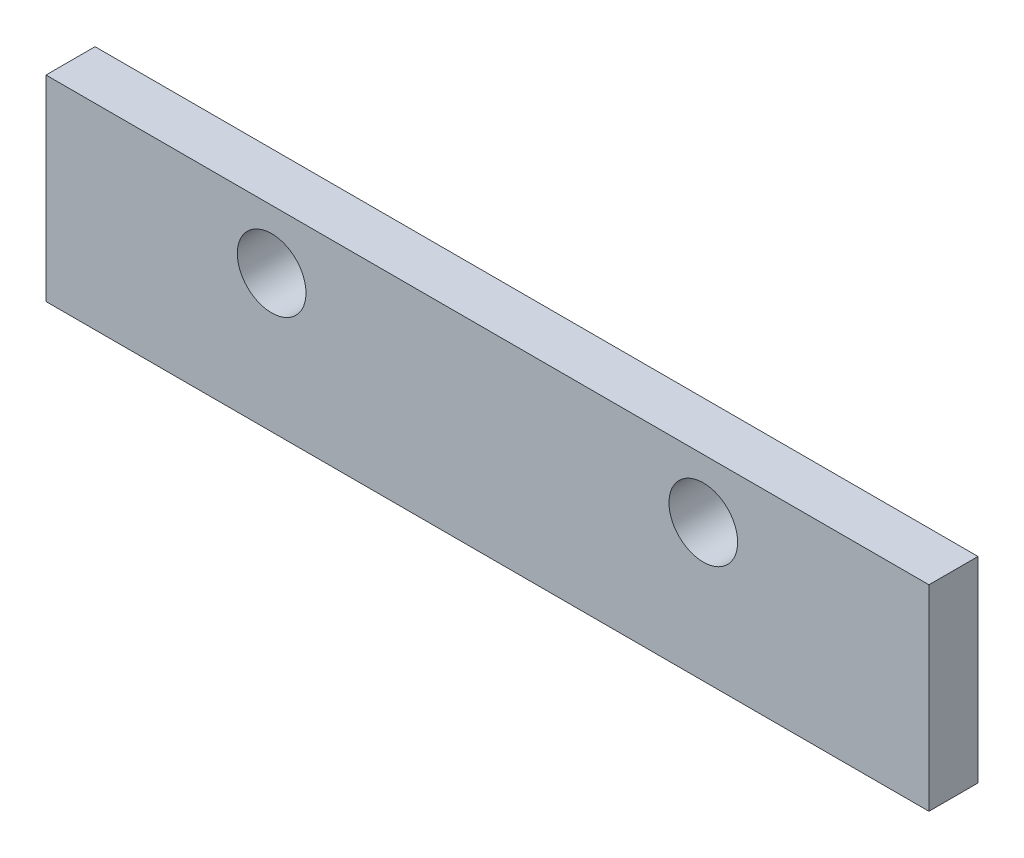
ISO-10303-21;
HEADER;
FILE_DESCRIPTION(('STEP AP214'),'2;1');
FILE_NAME('part.step','',(''),(''),'','','');
FILE_SCHEMA(('AUTOMOTIVE_DESIGN { 1 0 10303 214 1 1 1 1 }'));
ENDSEC;
DATA;
#1=APPLICATION_CONTEXT('core data for automotive mechanical design processes');
#2=APPLICATION_PROTOCOL_DEFINITION('international standard','automotive_design',2000,#1);
#3=PRODUCT_CONTEXT('',#1,'mechanical');
#4=PRODUCT('Part','Part','',(#3));
#5=PRODUCT_RELATED_PRODUCT_CATEGORY('part','',(#4));
#6=PRODUCT_DEFINITION_FORMATION('','',#4);
#7=PRODUCT_DEFINITION_CONTEXT('part definition',#1,'design');
#8=PRODUCT_DEFINITION('design','',#6,#7);
#9=PRODUCT_DEFINITION_SHAPE('','',#8);
#10=(LENGTH_UNIT() NAMED_UNIT(*) SI_UNIT(.MILLI.,.METRE.));
#11=(NAMED_UNIT(*) PLANE_ANGLE_UNIT() SI_UNIT($,.RADIAN.));
#12=(NAMED_UNIT(*) SI_UNIT($,.STERADIAN.) SOLID_ANGLE_UNIT());
#13=UNCERTAINTY_MEASURE_WITH_UNIT(LENGTH_MEASURE(1.E-05),#10,'distance_accuracy_value','');
#14=(GEOMETRIC_REPRESENTATION_CONTEXT(3) GLOBAL_UNCERTAINTY_ASSIGNED_CONTEXT((#13)) GLOBAL_UNIT_ASSIGNED_CONTEXT((#10,
#11,#12)) REPRESENTATION_CONTEXT('',''));
#15=CARTESIAN_POINT('',(0.,0.,0.));
#16=DIRECTION('',(0.,0.,1.));
#17=DIRECTION('',(1.,0.,0.));
#18=AXIS2_PLACEMENT_3D('',#15,#16,#17);
#19=CARTESIAN_POINT('',(-45.,-10.,5.));
#20=DIRECTION('',(0.,0.,1.));
#21=DIRECTION('',(1.,0.,0.));
#22=AXIS2_PLACEMENT_3D('',#19,#20,#21);
#23=PLANE('',#22);
#24=CARTESIAN_POINT('',(-22.,4.,5.));
#25=DIRECTION('',(0.,0.,1.));
#26=DIRECTION('',(1.,0.,0.));
#27=AXIS2_PLACEMENT_3D('',#24,#25,#26);
#28=CIRCLE('',#27,3.5);
#29=CARTESIAN_POINT('',(-18.5,4.,5.));
#30=VERTEX_POINT('',#29);
#31=EDGE_CURVE('E87',#30,#30,#28,.T.);
#32=ORIENTED_EDGE('',*,*,#31,.F.);
#33=EDGE_LOOP('',(#32));
#34=FACE_BOUND('',#33,.T.);
#35=DIRECTION('',(0.,-1.,0.));
#36=VECTOR('',#35,1.);
#37=CARTESIAN_POINT('',(-45.,10.,5.));
#38=LINE('',#37,#36);
#39=CARTESIAN_POINT('',(-45.,10.,5.));
#40=VERTEX_POINT('',#39);
#41=CARTESIAN_POINT('',(-45.,-10.,5.));
#42=VERTEX_POINT('',#41);
#43=EDGE_CURVE('E97',#40,#42,#38,.T.);
#44=ORIENTED_EDGE('',*,*,#43,.T.);
#45=DIRECTION('',(1.,0.,0.));
#46=VECTOR('',#45,1.);
#47=CARTESIAN_POINT('',(-45.,-10.,5.));
#48=LINE('',#47,#46);
#49=CARTESIAN_POINT('',(45.,-10.,5.));
#50=VERTEX_POINT('',#49);
#51=EDGE_CURVE('E82',#42,#50,#48,.T.);
#52=ORIENTED_EDGE('',*,*,#51,.T.);
#53=DIRECTION('',(0.,1.,0.));
#54=VECTOR('',#53,1.);
#55=CARTESIAN_POINT('',(45.,10.,5.));
#56=LINE('',#55,#54);
#57=CARTESIAN_POINT('',(45.,10.,5.));
#58=VERTEX_POINT('',#57);
#59=EDGE_CURVE('E48',#50,#58,#56,.T.);
#60=ORIENTED_EDGE('',*,*,#59,.T.);
#61=DIRECTION('',(-1.,0.,0.));
#62=VECTOR('',#61,1.);
#63=CARTESIAN_POINT('',(-45.,10.,5.));
#64=LINE('',#63,#62);
#65=EDGE_CURVE('E43',#58,#40,#64,.T.);
#66=ORIENTED_EDGE('',*,*,#65,.T.);
#67=EDGE_LOOP('',(#44,#52,#60,#66));
#68=FACE_BOUND('',#67,.T.);
#69=CARTESIAN_POINT('',(22.,4.,5.));
#70=DIRECTION('',(0.,0.,1.));
#71=DIRECTION('',(1.,0.,0.));
#72=AXIS2_PLACEMENT_3D('',#69,#70,#71);
#73=CIRCLE('',#72,3.5);
#74=CARTESIAN_POINT('',(25.5,4.,5.));
#75=VERTEX_POINT('',#74);
#76=EDGE_CURVE('E115',#75,#75,#73,.T.);
#77=ORIENTED_EDGE('',*,*,#76,.F.);
#78=EDGE_LOOP('',(#77));
#79=FACE_BOUND('',#78,.T.);
#80=ADVANCED_FACE('F28',(#34,#68,#79),#23,.T.);
#81=CARTESIAN_POINT('',(-45.,-10.,0.));
#82=DIRECTION('',(0.,0.,1.));
#83=DIRECTION('',(1.,0.,0.));
#84=AXIS2_PLACEMENT_3D('',#81,#82,#83);
#85=PLANE('',#84);
#86=CARTESIAN_POINT('',(-22.,4.,0.));
#87=DIRECTION('',(0.,0.,1.));
#88=DIRECTION('',(1.,0.,0.));
#89=AXIS2_PLACEMENT_3D('',#86,#87,#88);
#90=CIRCLE('',#89,3.5);
#91=CARTESIAN_POINT('',(-18.5,4.,0.));
#92=VERTEX_POINT('',#91);
#93=EDGE_CURVE('E90',#92,#92,#90,.T.);
#94=ORIENTED_EDGE('',*,*,#93,.T.);
#95=EDGE_LOOP('',(#94));
#96=FACE_BOUND('',#95,.T.);
#97=DIRECTION('',(0.,-1.,0.));
#98=VECTOR('',#97,1.);
#99=CARTESIAN_POINT('',(-45.,10.,0.));
#100=LINE('',#99,#98);
#101=CARTESIAN_POINT('',(-45.,10.,0.));
#102=VERTEX_POINT('',#101);
#103=CARTESIAN_POINT('',(-45.,-10.,0.));
#104=VERTEX_POINT('',#103);
#105=EDGE_CURVE('E74',#102,#104,#100,.T.);
#106=ORIENTED_EDGE('',*,*,#105,.F.);
#107=DIRECTION('',(-1.,0.,0.));
#108=VECTOR('',#107,1.);
#109=CARTESIAN_POINT('',(-45.,10.,0.));
#110=LINE('',#109,#108);
#111=CARTESIAN_POINT('',(45.,10.,0.));
#112=VERTEX_POINT('',#111);
#113=EDGE_CURVE('E95',#112,#102,#110,.T.);
#114=ORIENTED_EDGE('',*,*,#113,.F.);
#115=DIRECTION('',(0.,1.,0.));
#116=VECTOR('',#115,1.);
#117=CARTESIAN_POINT('',(45.,10.,0.));
#118=LINE('',#117,#116);
#119=CARTESIAN_POINT('',(45.,-10.,0.));
#120=VERTEX_POINT('',#119);
#121=EDGE_CURVE('E75',#120,#112,#118,.T.);
#122=ORIENTED_EDGE('',*,*,#121,.F.);
#123=DIRECTION('',(1.,0.,0.));
#124=VECTOR('',#123,1.);
#125=CARTESIAN_POINT('',(-45.,-10.,0.));
#126=LINE('',#125,#124);
#127=EDGE_CURVE('E69',#104,#120,#126,.T.);
#128=ORIENTED_EDGE('',*,*,#127,.F.);
#129=EDGE_LOOP('',(#106,#114,#122,#128));
#130=FACE_BOUND('',#129,.T.);
#131=CARTESIAN_POINT('',(22.,4.,0.));
#132=DIRECTION('',(0.,0.,1.));
#133=DIRECTION('',(1.,0.,0.));
#134=AXIS2_PLACEMENT_3D('',#131,#132,#133);
#135=CIRCLE('',#134,3.5);
#136=CARTESIAN_POINT('',(25.5,4.,0.));
#137=VERTEX_POINT('',#136);
#138=EDGE_CURVE('E117',#137,#137,#135,.T.);
#139=ORIENTED_EDGE('',*,*,#138,.T.);
#140=EDGE_LOOP('',(#139));
#141=FACE_BOUND('',#140,.T.);
#142=ADVANCED_FACE('F70',(#96,#130,#141),#85,.F.);
#143=CARTESIAN_POINT('',(-45.,10.,5.));
#144=DIRECTION('',(1.,0.,0.));
#145=DIRECTION('',(0.,0.,-1.));
#146=AXIS2_PLACEMENT_3D('',#143,#144,#145);
#147=PLANE('',#146);
#148=ORIENTED_EDGE('',*,*,#105,.T.);
#149=DIRECTION('',(0.,0.,-1.));
#150=VECTOR('',#149,1.);
#151=CARTESIAN_POINT('',(-45.,-10.,5.));
#152=LINE('',#151,#150);
#153=EDGE_CURVE('E11',#42,#104,#152,.T.);
#154=ORIENTED_EDGE('',*,*,#153,.F.);
#155=ORIENTED_EDGE('',*,*,#43,.F.);
#156=DIRECTION('',(0.,0.,-1.));
#157=VECTOR('',#156,1.);
#158=CARTESIAN_POINT('',(-45.,10.,5.));
#159=LINE('',#158,#157);
#160=EDGE_CURVE('E86',#40,#102,#159,.T.);
#161=ORIENTED_EDGE('',*,*,#160,.T.);
#162=EDGE_LOOP('',(#148,#154,#155,#161));
#163=FACE_BOUND('',#162,.T.);
#164=ADVANCED_FACE('F30',(#163),#147,.F.);
#165=CARTESIAN_POINT('',(-45.,-10.,5.));
#166=DIRECTION('',(0.,1.,0.));
#167=DIRECTION('',(-1.,0.,0.));
#168=AXIS2_PLACEMENT_3D('',#165,#166,#167);
#169=PLANE('',#168);
#170=ORIENTED_EDGE('',*,*,#127,.T.);
#171=DIRECTION('',(0.,0.,-1.));
#172=VECTOR('',#171,1.);
#173=CARTESIAN_POINT('',(45.,-10.,5.));
#174=LINE('',#173,#172);
#175=EDGE_CURVE('E36',#50,#120,#174,.T.);
#176=ORIENTED_EDGE('',*,*,#175,.F.);
#177=ORIENTED_EDGE('',*,*,#51,.F.);
#178=ORIENTED_EDGE('',*,*,#153,.T.);
#179=EDGE_LOOP('',(#170,#176,#177,#178));
#180=FACE_BOUND('',#179,.T.);
#181=ADVANCED_FACE('F81',(#180),#169,.F.);
#182=CARTESIAN_POINT('',(45.,10.,5.));
#183=DIRECTION('',(-1.,0.,0.));
#184=DIRECTION('',(0.,0.,1.));
#185=AXIS2_PLACEMENT_3D('',#182,#183,#184);
#186=PLANE('',#185);
#187=ORIENTED_EDGE('',*,*,#121,.T.);
#188=DIRECTION('',(0.,0.,-1.));
#189=VECTOR('',#188,1.);
#190=CARTESIAN_POINT('',(45.,10.,5.));
#191=LINE('',#190,#189);
#192=EDGE_CURVE('E103',#58,#112,#191,.T.);
#193=ORIENTED_EDGE('',*,*,#192,.F.);
#194=ORIENTED_EDGE('',*,*,#59,.F.);
#195=ORIENTED_EDGE('',*,*,#175,.T.);
#196=EDGE_LOOP('',(#187,#193,#194,#195));
#197=FACE_BOUND('',#196,.T.);
#198=ADVANCED_FACE('F106',(#197),#186,.F.);
#199=CARTESIAN_POINT('',(-45.,10.,5.));
#200=DIRECTION('',(0.,-1.,0.));
#201=DIRECTION('',(1.,0.,0.));
#202=AXIS2_PLACEMENT_3D('',#199,#200,#201);
#203=PLANE('',#202);
#204=ORIENTED_EDGE('',*,*,#113,.T.);
#205=ORIENTED_EDGE('',*,*,#160,.F.);
#206=ORIENTED_EDGE('',*,*,#65,.F.);
#207=ORIENTED_EDGE('',*,*,#192,.T.);
#208=EDGE_LOOP('',(#204,#205,#206,#207));
#209=FACE_BOUND('',#208,.T.);
#210=ADVANCED_FACE('F108',(#209),#203,.F.);
#211=CARTESIAN_POINT('',(-22.,4.,5.));
#212=DIRECTION('',(0.,0.,-1.));
#213=DIRECTION('',(-1.,0.,0.));
#214=AXIS2_PLACEMENT_3D('',#211,#212,#213);
#215=CYLINDRICAL_SURFACE('',#214,3.5);
#216=ORIENTED_EDGE('',*,*,#31,.T.);
#217=EDGE_LOOP('',(#216));
#218=FACE_BOUND('',#217,.T.);
#219=ORIENTED_EDGE('',*,*,#93,.F.);
#220=EDGE_LOOP('',(#219));
#221=FACE_BOUND('',#220,.T.);
#222=ADVANCED_FACE('F126',(#218,#221),#215,.F.);
#223=CARTESIAN_POINT('',(22.,4.,5.));
#224=DIRECTION('',(0.,0.,-1.));
#225=DIRECTION('',(-1.,0.,0.));
#226=AXIS2_PLACEMENT_3D('',#223,#224,#225);
#227=CYLINDRICAL_SURFACE('',#226,3.5);
#228=ORIENTED_EDGE('',*,*,#76,.T.);
#229=EDGE_LOOP('',(#228));
#230=FACE_BOUND('',#229,.T.);
#231=ORIENTED_EDGE('',*,*,#138,.F.);
#232=EDGE_LOOP('',(#231));
#233=FACE_BOUND('',#232,.T.);
#234=ADVANCED_FACE('F124',(#230,#233),#227,.F.);
#235=CLOSED_SHELL('',(#80,#142,#164,#181,#198,#210,#222,#234));
#236=MANIFOLD_SOLID_BREP('B2',#235);
#237=ADVANCED_BREP_SHAPE_REPRESENTATION('',(#18,#236),#14);
#238=SHAPE_DEFINITION_REPRESENTATION(#9,#237);
ENDSEC;
END-ISO-10303-21;
